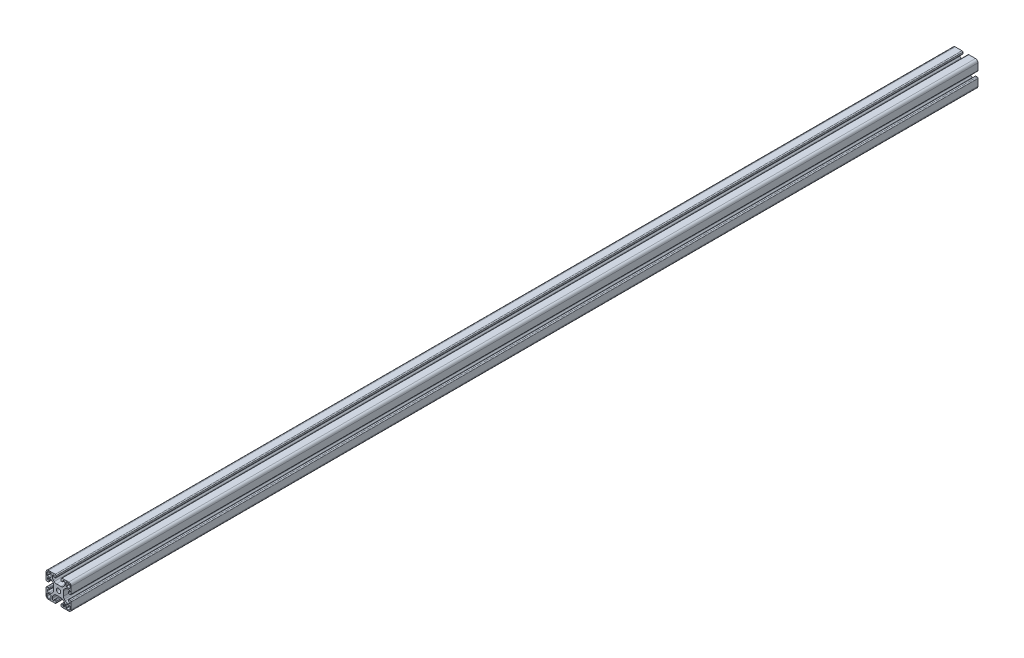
from build123d import *

# Parameters (mm, degrees)
SKETCH1_R           = 3.4
BOSS_EXTRUDE1_DEPTH = 720


with BuildPart() as part:
    # Sketch1 → Boss-Extrude1 (new, symmetric)
    with BuildSketch(Plane(origin=(0, 0, 0), x_dir=(-1, 0, 0), z_dir=(0, 0, -1))):
        with BuildLine():
            Line((-36.5, 16), (-38.5, 16))
            ThreePointArc((-38.5, 16), (-39.560660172, 15.560660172), (-40, 14.5))
            Line((-40, 14.5), (-40, 4))
            ThreePointArc((-40, 4), (-38.828427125, 1.171572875), (-36, 0))
            Line((-36, 0), (-25.5, 0))
            ThreePointArc((-25.5, 0), (-24.439339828, 0.439339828), (-24, 1.5))
            Line((-24, 1.5), (-24, 3.5))
            ThreePointArc((-24, 3.5), (-24.292893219, 4.207106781), (-25, 4.5))
            Line((-25, 4.5), (-26.5, 4.5))
            ThreePointArc((-26.5, 4.5), (-26.853553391, 4.353553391), (-27, 4))
            Line((-27, 4), (-27, 2.5))
            ThreePointArc((-27, 2.5), (-27.146446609, 2.146446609), (-27.5, 2))
            ThreePointArc((-27.5, 2), (-29.267766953, 2.732233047), (-30, 4.5))
            Line((-30, 4.5), (-30, 5.807611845))
            ThreePointArc((-30, 5.807611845), (-29.619397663, 7.721029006), (-28.535533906, 9.343145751))
            Line((-28.535533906, 9.343145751), (-27.09314575, 10.785533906))
            ThreePointArc((-27.09314575, 10.785533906), (-25.471029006, 11.869397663), (-23.557611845, 12.25))
            Line((-23.557611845, 12.25), (-16.442388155, 12.25))
            ThreePointArc((-16.442388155, 12.25), (-14.528970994, 11.869397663), (-12.90685425, 10.785533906))
            Line((-12.90685425, 10.785533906), (-11.464466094, 9.343145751))
            ThreePointArc((-11.464466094, 9.343145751), (-10.380602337, 7.721029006), (-10, 5.807611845))
            Line((-10, 5.807611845), (-10, 4.5))
            ThreePointArc((-10, 4.5), (-10.732233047, 2.732233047), (-12.5, 2))
            ThreePointArc((-12.5, 2), (-12.853553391, 2.146446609), (-13, 2.5))
            Line((-13, 2.5), (-13, 4))
            ThreePointArc((-13, 4), (-13.146446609, 4.353553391), (-13.5, 4.5))
            Line((-13.5, 4.5), (-15, 4.5))
            ThreePointArc((-15, 4.5), (-15.707106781, 4.207106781), (-16, 3.5))
            Line((-16, 3.5), (-16, 1.5))
            ThreePointArc((-16, 1.5), (-15.560660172, 0.439339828), (-14.5, 0))
            Line((-14.5, 0), (-4, 0))
            ThreePointArc((-4, 0), (-1.171572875, 1.171572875), (0, 4))
            Line((0, 4), (0, 14.5))
            ThreePointArc((0, 14.5), (-0.439339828, 15.560660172), (-1.5, 16))
            Line((-1.5, 16), (-3.5, 16))
            ThreePointArc((-3.5, 16), (-4.207106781, 15.707106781), (-4.5, 15))
            Line((-4.5, 15), (-4.5, 13.5))
            ThreePointArc((-4.5, 13.5), (-4.353553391, 13.146446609), (-4, 13))
            Line((-4, 13), (-2.5, 13))
            ThreePointArc((-2.5, 13), (-2.146446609, 12.853553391), (-2, 12.5))
            ThreePointArc((-2, 12.5), (-2.732233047, 10.732233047), (-4.5, 10))
            Line((-4.5, 10), (-5.807611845, 10))
            ThreePointArc((-5.807611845, 10), (-7.721029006, 10.380602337), (-9.343145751, 11.464466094))
            Line((-9.343145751, 11.464466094), (-10.785533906, 12.906854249))
            ThreePointArc((-10.785533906, 12.906854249), (-11.869397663, 14.528970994), (-12.25, 16.442388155))
            Line((-12.25, 16.442388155), (-12.25, 23.557611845))
            ThreePointArc((-12.25, 23.557611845), (-11.869397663, 25.471029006), (-10.785533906, 27.093145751))
            Line((-10.785533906, 27.093145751), (-9.343145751, 28.535533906))
            ThreePointArc((-9.343145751, 28.535533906), (-7.721029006, 29.619397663), (-5.807611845, 30))
            Line((-5.807611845, 30), (-4.5, 30))
            ThreePointArc((-4.5, 30), (-2.732233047, 29.267766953), (-2, 27.5))
            ThreePointArc((-2, 27.5), (-2.146446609, 27.146446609), (-2.5, 27))
            Line((-2.5, 27), (-4, 27))
            ThreePointArc((-4, 27), (-4.353553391, 26.853553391), (-4.5, 26.5))
            Line((-4.5, 26.5), (-4.5, 25))
            ThreePointArc((-4.5, 25), (-4.207106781, 24.292893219), (-3.5, 24))
            Line((-3.5, 24), (-1.5, 24))
            ThreePointArc((-1.5, 24), (-0.439339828, 24.439339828), (0, 25.5))
            Line((0, 25.5), (0, 36))
            ThreePointArc((0, 36), (-1.171572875, 38.828427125), (-4, 40))
            Line((-4, 40), (-14.5, 40))
            ThreePointArc((-14.5, 40), (-15.560660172, 39.560660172), (-16, 38.5))
            Line((-16, 38.5), (-16, 36.5))
            ThreePointArc((-16, 36.5), (-15.707106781, 35.792893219), (-15, 35.5))
            Line((-15, 35.5), (-13.5, 35.5))
            ThreePointArc((-13.5, 35.5), (-13.146446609, 35.646446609), (-13, 36))
            Line((-13, 36), (-13, 37.5))
            ThreePointArc((-13, 37.5), (-12.853553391, 37.853553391), (-12.5, 38))
            ThreePointArc((-12.5, 38), (-10.732233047, 37.267766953), (-10, 35.5))
            Line((-10, 35.5), (-10, 34.192388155))
            ThreePointArc((-10, 34.192388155), (-10.380602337, 32.278970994), (-11.464466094, 30.656854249))
            Line((-11.464466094, 30.656854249), (-12.90685425, 29.214466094))
            ThreePointArc((-12.90685425, 29.214466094), (-14.528970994, 28.130602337), (-16.442388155, 27.75))
            Line((-16.442388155, 27.75), (-23.557611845, 27.75))
            ThreePointArc((-23.557611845, 27.75), (-25.471029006, 28.130602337), (-27.09314575, 29.214466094))
            Line((-27.09314575, 29.214466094), (-28.535533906, 30.656854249))
            ThreePointArc((-28.535533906, 30.656854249), (-29.619397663, 32.278970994), (-30, 34.192388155))
            Line((-30, 34.192388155), (-30, 35.5))
            ThreePointArc((-30, 35.5), (-29.267766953, 37.267766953), (-27.5, 38))
            ThreePointArc((-27.5, 38), (-27.146446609, 37.853553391), (-27, 37.5))
            Line((-27, 37.5), (-27, 36))
            ThreePointArc((-27, 36), (-26.853553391, 35.646446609), (-26.5, 35.5))
            Line((-26.5, 35.5), (-25, 35.5))
            ThreePointArc((-25, 35.5), (-24.292893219, 35.792893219), (-24, 36.5))
            Line((-24, 36.5), (-24, 38.5))
            ThreePointArc((-24, 38.5), (-24.439339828, 39.560660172), (-25.5, 40))
            Line((-25.5, 40), (-36, 40))
            ThreePointArc((-36, 40), (-38.828427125, 38.828427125), (-40, 36))
            Line((-40, 36), (-40, 25.5))
            ThreePointArc((-40, 25.5), (-39.560660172, 24.439339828), (-38.5, 24))
            Line((-38.5, 24), (-36.5, 24))
            ThreePointArc((-36.5, 24), (-35.792893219, 24.292893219), (-35.5, 25))
            Line((-35.5, 25), (-35.5, 26.5))
            ThreePointArc((-35.5, 26.5), (-35.646446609, 26.853553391), (-36, 27))
            Line((-36, 27), (-37.5, 27))
            ThreePointArc((-37.5, 27), (-37.853553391, 27.146446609), (-38, 27.5))
            ThreePointArc((-38, 27.5), (-37.267766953, 29.267766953), (-35.5, 30))
            Line((-35.5, 30), (-34.192388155, 30))
            ThreePointArc((-34.192388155, 30), (-32.278970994, 29.619397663), (-30.656854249, 28.535533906))
            Line((-30.656854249, 28.535533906), (-29.214466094, 27.093145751))
            ThreePointArc((-29.214466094, 27.093145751), (-28.130602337, 25.471029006), (-27.75, 23.557611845))
            Line((-27.75, 23.557611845), (-27.75, 16.442388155))
            ThreePointArc((-27.75, 16.442388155), (-28.130602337, 14.528970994), (-29.214466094, 12.906854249))
            Line((-29.214466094, 12.906854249), (-30.656854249, 11.464466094))
            ThreePointArc((-30.656854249, 11.464466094), (-32.278970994, 10.380602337), (-34.192388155, 10))
            Line((-34.192388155, 10), (-35.5, 10))
            ThreePointArc((-35.5, 10), (-37.267766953, 10.732233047), (-38, 12.5))
            ThreePointArc((-38, 12.5), (-37.853553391, 12.853553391), (-37.5, 13))
            Line((-37.5, 13), (-36, 13))
            ThreePointArc((-36, 13), (-35.646446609, 13.146446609), (-35.5, 13.5))
            Line((-35.5, 13.5), (-35.5, 15))
            ThreePointArc((-35.5, 15), (-35.792893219, 15.707106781), (-36.5, 16))
        make_face()
        with Locations((-20, 20)):
            Circle(SKETCH1_R, mode=Mode.SUBTRACT)
        with BuildLine():
            Line((-36, 38.2), (-32.3, 38.2))
            ThreePointArc((-32.3, 38.2), (-31.946446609, 38.053553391), (-31.8, 37.7))
            Line((-31.8, 37.7), (-31.8, 32.3))
            ThreePointArc((-31.8, 32.3), (-31.946446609, 31.946446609), (-32.3, 31.8))
            Line((-32.3, 31.8), (-37.7, 31.8))
            ThreePointArc((-37.7, 31.8), (-38.053553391, 31.946446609), (-38.2, 32.3))
            Line((-38.2, 32.3), (-38.2, 36))
            ThreePointArc((-38.2, 36), (-37.555634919, 37.555634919), (-36, 38.2))
        make_face(mode=Mode.SUBTRACT)
        with BuildLine():
            Line((-32.3, 1.8), (-36, 1.8))
            ThreePointArc((-36, 1.8), (-37.555634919, 2.444365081), (-38.2, 4))
            Line((-38.2, 4), (-38.2, 7.7))
            ThreePointArc((-38.2, 7.7), (-38.053553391, 8.053553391), (-37.7, 8.2))
            Line((-37.7, 8.2), (-32.3, 8.2))
            ThreePointArc((-32.3, 8.2), (-31.946446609, 8.053553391), (-31.8, 7.7))
            Line((-31.8, 7.7), (-31.8, 2.3))
            ThreePointArc((-31.8, 2.3), (-31.946446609, 1.946446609), (-32.3, 1.8))
        make_face(mode=Mode.SUBTRACT)
        with BuildLine():
            Line((-4, 1.8), (-7.7, 1.8))
            ThreePointArc((-7.7, 1.8), (-8.053553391, 1.946446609), (-8.2, 2.3))
            Line((-8.2, 2.3), (-8.2, 7.7))
            ThreePointArc((-8.2, 7.7), (-8.053553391, 8.053553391), (-7.7, 8.2))
            Line((-7.7, 8.2), (-2.3, 8.2))
            ThreePointArc((-2.3, 8.2), (-1.946446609, 8.053553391), (-1.8, 7.7))
            Line((-1.8, 7.7), (-1.8, 4))
            ThreePointArc((-1.8, 4), (-2.444365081, 2.444365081), (-4, 1.8))
        make_face(mode=Mode.SUBTRACT)
        with BuildLine():
            Line((-7.7, 38.2), (-4, 38.2))
            ThreePointArc((-4, 38.2), (-2.444365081, 37.555634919), (-1.8, 36))
            Line((-1.8, 36), (-1.8, 32.3))
            ThreePointArc((-1.8, 32.3), (-1.946446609, 31.946446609), (-2.3, 31.8))
            Line((-2.3, 31.8), (-7.7, 31.8))
            ThreePointArc((-7.7, 31.8), (-8.053553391, 31.946446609), (-8.2, 32.3))
            Line((-8.2, 32.3), (-8.2, 37.7))
            ThreePointArc((-8.2, 37.7), (-8.053553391, 38.053553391), (-7.7, 38.2))
        make_face(mode=Mode.SUBTRACT)
    extrude(amount=BOSS_EXTRUDE1_DEPTH, both=True)


solid = part.part
